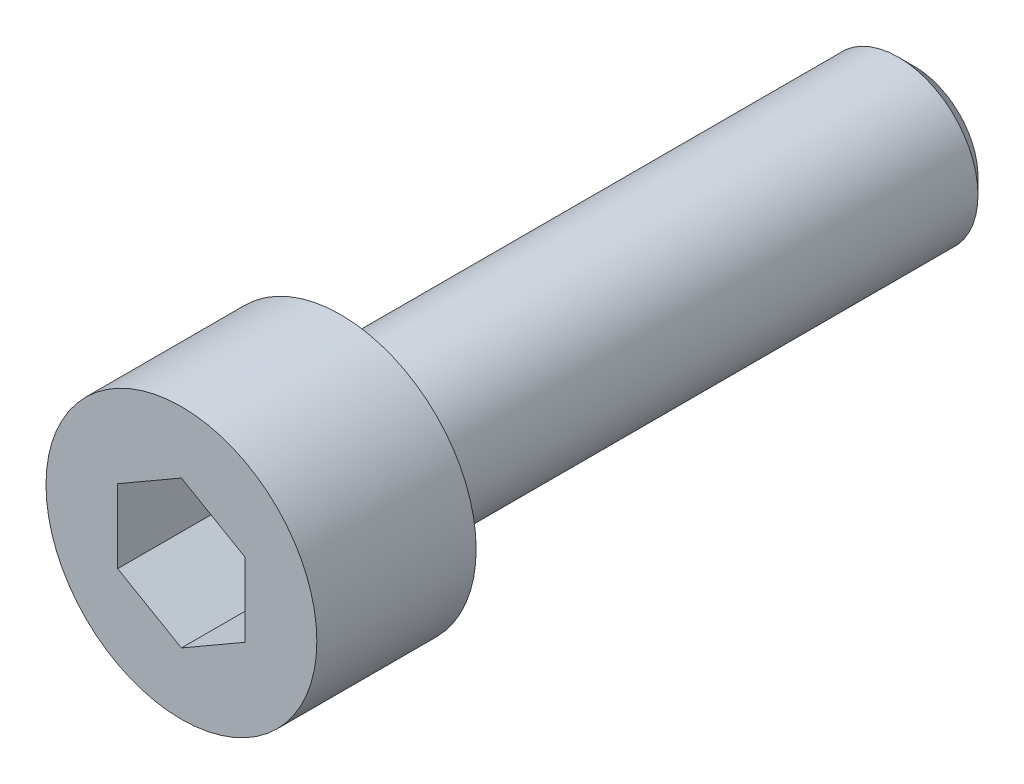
from build123d import *

# Parameters (mm, degrees)
SKETCH1_R           = 4.25
BASE_EXTRUDE_DEPTH  = 5
SKETCH2_R           = 2.5
BOSS_EXTRUDE1_DEPTH = 18
CUT_EXTRUDE1_DEPTH  = 5
CHAMFER1_SIZE       = 0.5


with BuildPart() as part:
    # Sketch1 → Base-Extrude (new body)
    with BuildSketch(Plane.XY):
        Circle(SKETCH1_R)
    extrude(amount=-BASE_EXTRUDE_DEPTH)

    # Sketch2 → Boss-Extrude1 (add)
    with BuildSketch(Plane(origin=(0, 0, -5), x_dir=(-1, 0, 0), z_dir=(0, 0, -1))):
        with Locations(Location((0, 0, 0), (0, 0, 180))):
            Circle(SKETCH2_R)
    extrude(amount=BOSS_EXTRUDE1_DEPTH)

    # Sketch3 → Cut-Extrude1 (cut)
    with BuildSketch(Plane.XY):
        Polygon((2, -1.154700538), (2, 1.154700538), (0, 2.309401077), (-2, 1.154700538), (-2, -1.154700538), (0, -2.309401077), align=None)
    extrude(amount=-CUT_EXTRUDE1_DEPTH, mode=Mode.SUBTRACT)

    # Chamfer1
    chamfer1_edges = [part.edges().sort_by_distance(p)[0] for p in [
        (-2.5, 0, -23),
    ]]
    chamfer(chamfer1_edges, length=CHAMFER1_SIZE)


solid = part.part
